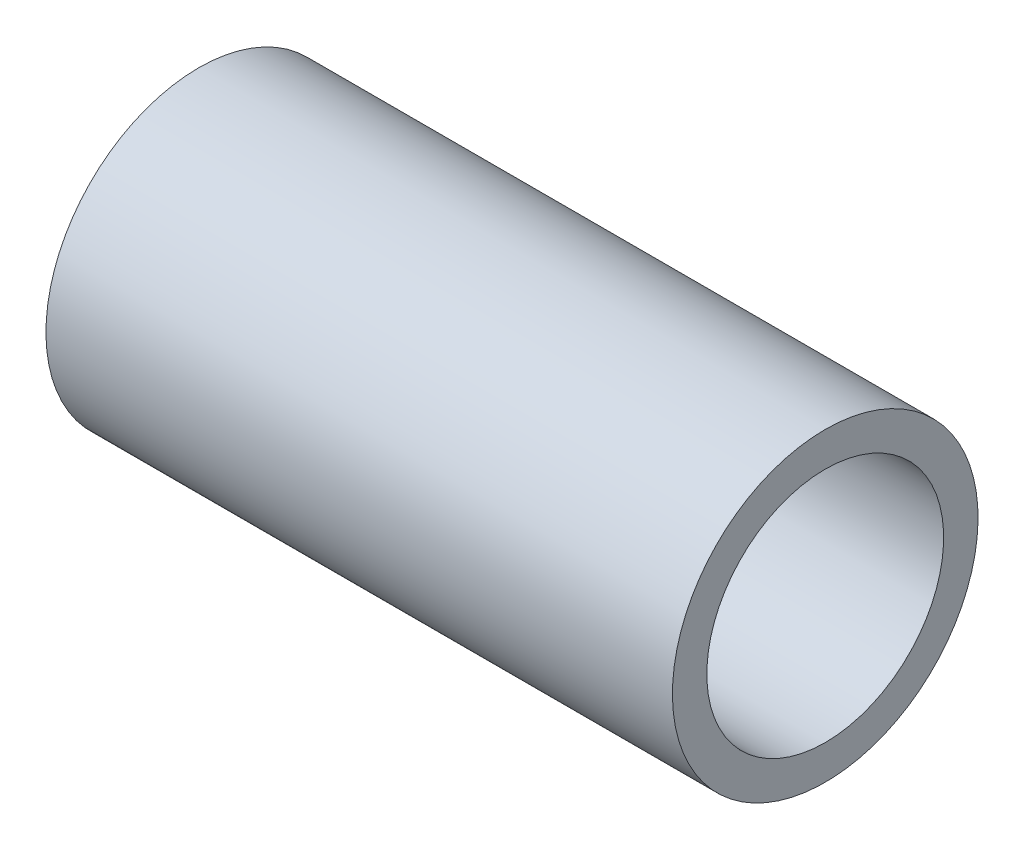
ISO-10303-21;
HEADER;
FILE_DESCRIPTION(('STEP AP214'),'2;1');
FILE_NAME('part.step','',(''),(''),'','','');
FILE_SCHEMA(('AUTOMOTIVE_DESIGN { 1 0 10303 214 1 1 1 1 }'));
ENDSEC;
DATA;
#1=APPLICATION_CONTEXT('core data for automotive mechanical design processes');
#2=APPLICATION_PROTOCOL_DEFINITION('international standard','automotive_design',2000,#1);
#3=PRODUCT_CONTEXT('',#1,'mechanical');
#4=PRODUCT('Part','Part','',(#3));
#5=PRODUCT_RELATED_PRODUCT_CATEGORY('part','',(#4));
#6=PRODUCT_DEFINITION_FORMATION('','',#4);
#7=PRODUCT_DEFINITION_CONTEXT('part definition',#1,'design');
#8=PRODUCT_DEFINITION('design','',#6,#7);
#9=PRODUCT_DEFINITION_SHAPE('','',#8);
#10=(LENGTH_UNIT() NAMED_UNIT(*) SI_UNIT(.MILLI.,.METRE.));
#11=(NAMED_UNIT(*) PLANE_ANGLE_UNIT() SI_UNIT($,.RADIAN.));
#12=(NAMED_UNIT(*) SI_UNIT($,.STERADIAN.) SOLID_ANGLE_UNIT());
#13=UNCERTAINTY_MEASURE_WITH_UNIT(LENGTH_MEASURE(1.E-05),#10,'distance_accuracy_value','');
#14=(GEOMETRIC_REPRESENTATION_CONTEXT(3) GLOBAL_UNCERTAINTY_ASSIGNED_CONTEXT((#13)) GLOBAL_UNIT_ASSIGNED_CONTEXT((#10,
#11,#12)) REPRESENTATION_CONTEXT('',''));
#15=CARTESIAN_POINT('',(0.,0.,0.));
#16=DIRECTION('',(0.,0.,1.));
#17=DIRECTION('',(1.,0.,0.));
#18=AXIS2_PLACEMENT_3D('',#15,#16,#17);
#19=CARTESIAN_POINT('',(41.,0.,0.));
#20=DIRECTION('',(-1.,0.,0.));
#21=DIRECTION('',(0.,0.,1.));
#22=AXIS2_PLACEMENT_3D('',#19,#20,#21);
#23=CYLINDRICAL_SURFACE('',#22,15.5);
#24=CARTESIAN_POINT('',(41.,0.,0.));
#25=DIRECTION('',(-1.,0.,0.));
#26=DIRECTION('',(0.,1.,0.));
#27=AXIS2_PLACEMENT_3D('',#24,#25,#26);
#28=CIRCLE('',#27,15.5);
#29=CARTESIAN_POINT('',(41.,15.5,0.));
#30=VERTEX_POINT('',#29);
#31=EDGE_CURVE('E10',#30,#30,#28,.T.);
#32=ORIENTED_EDGE('',*,*,#31,.F.);
#33=EDGE_LOOP('',(#32));
#34=FACE_BOUND('',#33,.T.);
#35=CARTESIAN_POINT('',(-41.,0.,0.));
#36=DIRECTION('',(-1.,0.,0.));
#37=DIRECTION('',(0.,1.,0.));
#38=AXIS2_PLACEMENT_3D('',#35,#36,#37);
#39=CIRCLE('',#38,15.5);
#40=CARTESIAN_POINT('',(-41.,15.5,0.));
#41=VERTEX_POINT('',#40);
#42=EDGE_CURVE('E26',#41,#41,#39,.T.);
#43=ORIENTED_EDGE('',*,*,#42,.T.);
#44=EDGE_LOOP('',(#43));
#45=FACE_BOUND('',#44,.T.);
#46=ADVANCED_FACE('F15',(#34,#45),#23,.F.);
#47=CARTESIAN_POINT('',(41.,0.,0.));
#48=DIRECTION('',(-1.,0.,0.));
#49=DIRECTION('',(0.,0.,1.));
#50=AXIS2_PLACEMENT_3D('',#47,#48,#49);
#51=CYLINDRICAL_SURFACE('',#50,20.);
#52=CARTESIAN_POINT('',(41.,0.,0.));
#53=DIRECTION('',(-1.,0.,0.));
#54=DIRECTION('',(0.,1.,0.));
#55=AXIS2_PLACEMENT_3D('',#52,#53,#54);
#56=CIRCLE('',#55,20.);
#57=CARTESIAN_POINT('',(41.,20.,0.));
#58=VERTEX_POINT('',#57);
#59=EDGE_CURVE('E22',#58,#58,#56,.T.);
#60=ORIENTED_EDGE('',*,*,#59,.T.);
#61=EDGE_LOOP('',(#60));
#62=FACE_BOUND('',#61,.T.);
#63=CARTESIAN_POINT('',(-41.,0.,0.));
#64=DIRECTION('',(-1.,0.,0.));
#65=DIRECTION('',(0.,1.,0.));
#66=AXIS2_PLACEMENT_3D('',#63,#64,#65);
#67=CIRCLE('',#66,20.);
#68=CARTESIAN_POINT('',(-41.,20.,0.));
#69=VERTEX_POINT('',#68);
#70=EDGE_CURVE('E31',#69,#69,#67,.T.);
#71=ORIENTED_EDGE('',*,*,#70,.F.);
#72=EDGE_LOOP('',(#71));
#73=FACE_BOUND('',#72,.T.);
#74=ADVANCED_FACE('F17',(#62,#73),#51,.T.);
#75=CARTESIAN_POINT('',(41.,0.,0.));
#76=DIRECTION('',(-1.,0.,0.));
#77=DIRECTION('',(0.,-1.,0.));
#78=AXIS2_PLACEMENT_3D('',#75,#76,#77);
#79=PLANE('',#78);
#80=ORIENTED_EDGE('',*,*,#31,.T.);
#81=EDGE_LOOP('',(#80));
#82=FACE_BOUND('',#81,.T.);
#83=ORIENTED_EDGE('',*,*,#59,.F.);
#84=EDGE_LOOP('',(#83));
#85=FACE_BOUND('',#84,.T.);
#86=ADVANCED_FACE('F43',(#82,#85),#79,.F.);
#87=CARTESIAN_POINT('',(-41.,0.,0.));
#88=DIRECTION('',(-1.,0.,0.));
#89=DIRECTION('',(0.,-1.,0.));
#90=AXIS2_PLACEMENT_3D('',#87,#88,#89);
#91=PLANE('',#90);
#92=ORIENTED_EDGE('',*,*,#42,.F.);
#93=EDGE_LOOP('',(#92));
#94=FACE_BOUND('',#93,.T.);
#95=ORIENTED_EDGE('',*,*,#70,.T.);
#96=EDGE_LOOP('',(#95));
#97=FACE_BOUND('',#96,.T.);
#98=ADVANCED_FACE('F40',(#94,#97),#91,.T.);
#99=CLOSED_SHELL('',(#46,#74,#86,#98));
#100=MANIFOLD_SOLID_BREP('B1',#99);
#101=ADVANCED_BREP_SHAPE_REPRESENTATION('',(#18,#100),#14);
#102=SHAPE_DEFINITION_REPRESENTATION(#9,#101);
ENDSEC;
END-ISO-10303-21;
